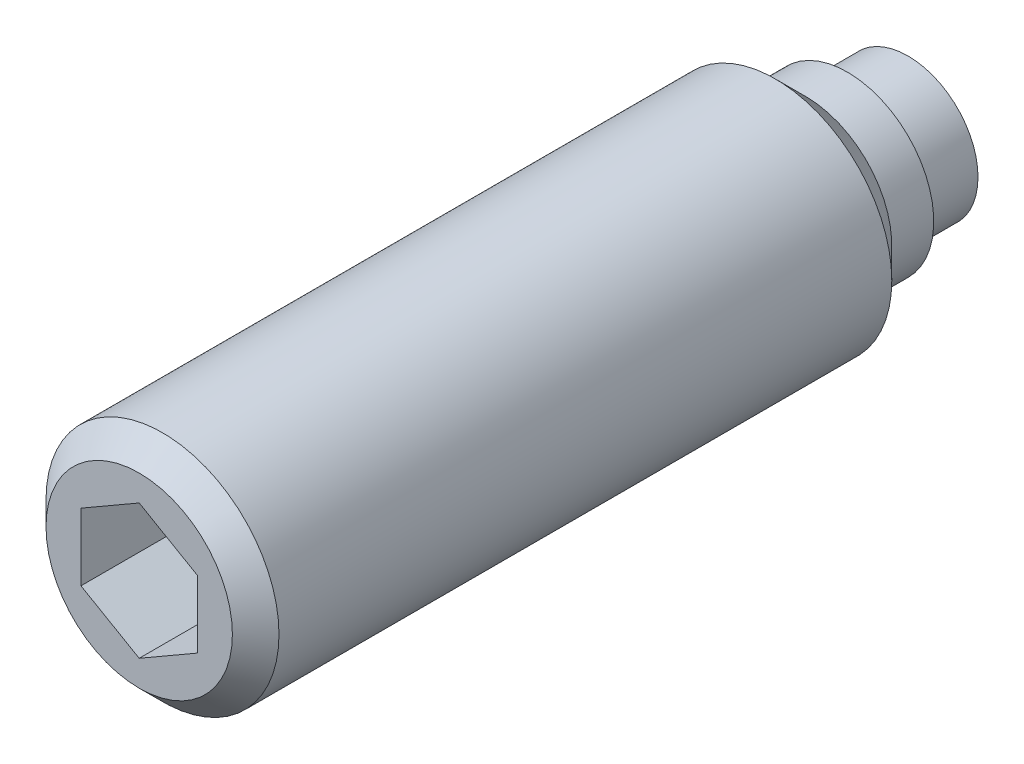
ISO-10303-21;
HEADER;
FILE_DESCRIPTION(('STEP AP214'),'2;1');
FILE_NAME('part.step','',(''),(''),'','','');
FILE_SCHEMA(('AUTOMOTIVE_DESIGN { 1 0 10303 214 1 1 1 1 }'));
ENDSEC;
DATA;
#1=APPLICATION_CONTEXT('core data for automotive mechanical design processes');
#2=APPLICATION_PROTOCOL_DEFINITION('international standard','automotive_design',2000,#1);
#3=PRODUCT_CONTEXT('',#1,'mechanical');
#4=PRODUCT('Part','Part','',(#3));
#5=PRODUCT_RELATED_PRODUCT_CATEGORY('part','',(#4));
#6=PRODUCT_DEFINITION_FORMATION('','',#4);
#7=PRODUCT_DEFINITION_CONTEXT('part definition',#1,'design');
#8=PRODUCT_DEFINITION('design','',#6,#7);
#9=PRODUCT_DEFINITION_SHAPE('','',#8);
#10=(LENGTH_UNIT() NAMED_UNIT(*) SI_UNIT(.MILLI.,.METRE.));
#11=(NAMED_UNIT(*) PLANE_ANGLE_UNIT() SI_UNIT($,.RADIAN.));
#12=(NAMED_UNIT(*) SI_UNIT($,.STERADIAN.) SOLID_ANGLE_UNIT());
#13=UNCERTAINTY_MEASURE_WITH_UNIT(LENGTH_MEASURE(1.E-05),#10,'distance_accuracy_value','');
#14=(GEOMETRIC_REPRESENTATION_CONTEXT(3) GLOBAL_UNCERTAINTY_ASSIGNED_CONTEXT((#13)) GLOBAL_UNIT_ASSIGNED_CONTEXT((#10,
#11,#12)) REPRESENTATION_CONTEXT('',''));
#15=CARTESIAN_POINT('',(0.,0.,0.));
#16=DIRECTION('',(0.,0.,1.));
#17=DIRECTION('',(1.,0.,0.));
#18=AXIS2_PLACEMENT_3D('',#15,#16,#17);
#19=CARTESIAN_POINT('',(0.,1.85,1.8));
#20=DIRECTION('',(0.,0.,1.));
#21=DIRECTION('',(1.,0.,0.));
#22=AXIS2_PLACEMENT_3D('',#19,#20,#21);
#23=PLANE('',#22);
#24=CARTESIAN_POINT('',(0.,0.,1.8));
#25=DIRECTION('',(0.,0.,-1.));
#26=DIRECTION('',(-1.,0.,0.));
#27=AXIS2_PLACEMENT_3D('',#24,#25,#26);
#28=CIRCLE('',#27,1.5);
#29=CARTESIAN_POINT('',(-1.5,0.,1.8));
#30=VERTEX_POINT('',#29);
#31=EDGE_CURVE('E124',#30,#30,#28,.T.);
#32=ORIENTED_EDGE('',*,*,#31,.F.);
#33=EDGE_LOOP('',(#32));
#34=FACE_BOUND('',#33,.T.);
#35=CARTESIAN_POINT('',(0.,0.,1.8));
#36=DIRECTION('',(0.,0.,-1.));
#37=DIRECTION('',(-1.,0.,0.));
#38=AXIS2_PLACEMENT_3D('',#35,#36,#37);
#39=CIRCLE('',#38,1.85);
#40=CARTESIAN_POINT('',(-1.85,0.,1.8));
#41=VERTEX_POINT('',#40);
#42=EDGE_CURVE('E127',#41,#41,#39,.T.);
#43=ORIENTED_EDGE('',*,*,#42,.T.);
#44=EDGE_LOOP('',(#43));
#45=FACE_BOUND('',#44,.T.);
#46=ADVANCED_FACE('F14',(#34,#45),#23,.F.);
#47=CARTESIAN_POINT('',(0.,0.,1.8));
#48=DIRECTION('',(0.,0.,-1.));
#49=DIRECTION('',(-1.,0.,0.));
#50=AXIS2_PLACEMENT_3D('',#47,#48,#49);
#51=CYLINDRICAL_SURFACE('',#50,2.5);
#52=CARTESIAN_POINT('',(0.,0.,16.5));
#53=DIRECTION('',(0.,0.,1.));
#54=DIRECTION('',(1.,0.,0.));
#55=AXIS2_PLACEMENT_3D('',#52,#53,#54);
#56=CIRCLE('',#55,2.5);
#57=CARTESIAN_POINT('',(2.5,0.,16.5));
#58=VERTEX_POINT('',#57);
#59=EDGE_CURVE('E9',#58,#58,#56,.F.);
#60=ORIENTED_EDGE('',*,*,#59,.T.);
#61=EDGE_LOOP('',(#60));
#62=FACE_BOUND('',#61,.T.);
#63=CARTESIAN_POINT('',(0.,0.,3.35));
#64=DIRECTION('',(0.,0.,-1.));
#65=DIRECTION('',(-1.,0.,0.));
#66=AXIS2_PLACEMENT_3D('',#63,#64,#65);
#67=CIRCLE('',#66,2.5);
#68=CARTESIAN_POINT('',(-2.5,0.,3.35));
#69=VERTEX_POINT('',#68);
#70=EDGE_CURVE('E133',#69,#69,#67,.T.);
#71=ORIENTED_EDGE('',*,*,#70,.F.);
#72=EDGE_LOOP('',(#71));
#73=FACE_BOUND('',#72,.T.);
#74=ADVANCED_FACE('F151',(#62,#73),#51,.T.);
#75=CARTESIAN_POINT('',(0.,0.,3.35));
#76=DIRECTION('',(0.,0.,1.));
#77=DIRECTION('',(1.,0.,0.));
#78=AXIS2_PLACEMENT_3D('',#75,#76,#77);
#79=CONICAL_SURFACE('',#78,2.5,0.785398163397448);
#80=CARTESIAN_POINT('',(0.,0.,2.7));
#81=DIRECTION('',(0.,0.,-1.));
#82=DIRECTION('',(-1.,0.,0.));
#83=AXIS2_PLACEMENT_3D('',#80,#81,#82);
#84=CIRCLE('',#83,1.85);
#85=CARTESIAN_POINT('',(-1.85,0.,2.7));
#86=VERTEX_POINT('',#85);
#87=EDGE_CURVE('E130',#86,#86,#84,.T.);
#88=ORIENTED_EDGE('',*,*,#87,.F.);
#89=EDGE_LOOP('',(#88));
#90=FACE_BOUND('',#89,.T.);
#91=ORIENTED_EDGE('',*,*,#70,.T.);
#92=EDGE_LOOP('',(#91));
#93=FACE_BOUND('',#92,.T.);
#94=ADVANCED_FACE('F157',(#90,#93),#79,.T.);
#95=CARTESIAN_POINT('',(0.,0.,1.8));
#96=DIRECTION('',(0.,0.,-1.));
#97=DIRECTION('',(-1.,0.,0.));
#98=AXIS2_PLACEMENT_3D('',#95,#96,#97);
#99=CYLINDRICAL_SURFACE('',#98,1.85);
#100=ORIENTED_EDGE('',*,*,#42,.F.);
#101=EDGE_LOOP('',(#100));
#102=FACE_BOUND('',#101,.T.);
#103=ORIENTED_EDGE('',*,*,#87,.T.);
#104=EDGE_LOOP('',(#103));
#105=FACE_BOUND('',#104,.T.);
#106=ADVANCED_FACE('F165',(#102,#105),#99,.T.);
#107=CARTESIAN_POINT('',(0.,0.,0.));
#108=DIRECTION('',(0.,0.,-1.));
#109=DIRECTION('',(-1.,0.,0.));
#110=AXIS2_PLACEMENT_3D('',#107,#108,#109);
#111=CYLINDRICAL_SURFACE('',#110,1.5);
#112=CARTESIAN_POINT('',(0.,0.,0.5));
#113=DIRECTION('',(0.,0.,-1.));
#114=DIRECTION('',(-1.,0.,0.));
#115=AXIS2_PLACEMENT_3D('',#112,#113,#114);
#116=CIRCLE('',#115,1.5);
#117=CARTESIAN_POINT('',(-1.5,0.,0.5));
#118=VERTEX_POINT('',#117);
#119=EDGE_CURVE('E116',#118,#118,#116,.T.);
#120=ORIENTED_EDGE('',*,*,#119,.F.);
#121=EDGE_LOOP('',(#120));
#122=FACE_BOUND('',#121,.T.);
#123=ORIENTED_EDGE('',*,*,#31,.T.);
#124=EDGE_LOOP('',(#123));
#125=FACE_BOUND('',#124,.T.);
#126=ADVANCED_FACE('F163',(#122,#125),#111,.T.);
#127=CARTESIAN_POINT('',(0.,0.,2.49999999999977));
#128=DIRECTION('',(0.,0.,-1.));
#129=DIRECTION('',(1.,0.,0.));
#130=AXIS2_PLACEMENT_3D('',#127,#128,#129);
#131=SPHERICAL_SURFACE('',#130,2.49999999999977);
#132=ORIENTED_EDGE('',*,*,#119,.T.);
#133=EDGE_LOOP('',(#132));
#134=FACE_BOUND('',#133,.T.);
#135=ADVANCED_FACE('F194',(#134),#131,.T.);
#136=CARTESIAN_POINT('',(0.,0.,17.));
#137=DIRECTION('',(0.,0.,1.));
#138=DIRECTION('',(1.,0.,0.));
#139=AXIS2_PLACEMENT_3D('',#136,#137,#138);
#140=PLANE('',#139);
#141=CARTESIAN_POINT('',(0.,0.,17.));
#142=DIRECTION('',(0.,0.,1.));
#143=DIRECTION('',(1.,0.,0.));
#144=AXIS2_PLACEMENT_3D('',#141,#142,#143);
#145=CIRCLE('',#144,2.);
#146=CARTESIAN_POINT('',(2.,0.,17.));
#147=VERTEX_POINT('',#146);
#148=EDGE_CURVE('E22',#147,#147,#145,.T.);
#149=ORIENTED_EDGE('',*,*,#148,.T.);
#150=EDGE_LOOP('',(#149));
#151=FACE_BOUND('',#150,.T.);
#152=DIRECTION('',(-0.866025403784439,0.5,0.));
#153=VECTOR('',#152,1.);
#154=CARTESIAN_POINT('',(1.25,0.721687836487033,17.));
#155=LINE('',#154,#153);
#156=CARTESIAN_POINT('',(1.25,0.721687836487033,17.));
#157=VERTEX_POINT('',#156);
#158=CARTESIAN_POINT('',(0.,1.44337567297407,17.));
#159=VERTEX_POINT('',#158);
#160=EDGE_CURVE('E29',#157,#159,#155,.T.);
#161=ORIENTED_EDGE('',*,*,#160,.F.);
#162=DIRECTION('',(0.,1.,0.));
#163=VECTOR('',#162,1.);
#164=CARTESIAN_POINT('',(1.25,-0.721687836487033,17.));
#165=LINE('',#164,#163);
#166=CARTESIAN_POINT('',(1.25,-0.721687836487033,17.));
#167=VERTEX_POINT('',#166);
#168=EDGE_CURVE('E112',#167,#157,#165,.T.);
#169=ORIENTED_EDGE('',*,*,#168,.F.);
#170=DIRECTION('',(0.866025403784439,0.5,0.));
#171=VECTOR('',#170,1.);
#172=CARTESIAN_POINT('',(0.,-1.44337567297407,17.));
#173=LINE('',#172,#171);
#174=CARTESIAN_POINT('',(0.,-1.44337567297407,17.));
#175=VERTEX_POINT('',#174);
#176=EDGE_CURVE('E110',#175,#167,#173,.T.);
#177=ORIENTED_EDGE('',*,*,#176,.F.);
#178=DIRECTION('',(0.866025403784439,-0.5,0.));
#179=VECTOR('',#178,1.);
#180=CARTESIAN_POINT('',(-1.25,-0.721687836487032,17.));
#181=LINE('',#180,#179);
#182=CARTESIAN_POINT('',(-1.25,-0.721687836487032,17.));
#183=VERTEX_POINT('',#182);
#184=EDGE_CURVE('E77',#183,#175,#181,.T.);
#185=ORIENTED_EDGE('',*,*,#184,.F.);
#186=DIRECTION('',(0.,-1.,0.));
#187=VECTOR('',#186,1.);
#188=CARTESIAN_POINT('',(-1.25,0.721687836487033,17.));
#189=LINE('',#188,#187);
#190=CARTESIAN_POINT('',(-1.25,0.721687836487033,17.));
#191=VERTEX_POINT('',#190);
#192=EDGE_CURVE('E106',#191,#183,#189,.T.);
#193=ORIENTED_EDGE('',*,*,#192,.F.);
#194=DIRECTION('',(-0.866025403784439,-0.5,0.));
#195=VECTOR('',#194,1.);
#196=CARTESIAN_POINT('',(0.,1.44337567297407,17.));
#197=LINE('',#196,#195);
#198=EDGE_CURVE('E103',#159,#191,#197,.T.);
#199=ORIENTED_EDGE('',*,*,#198,.F.);
#200=EDGE_LOOP('',(#161,#169,#177,#185,#193,#199));
#201=FACE_BOUND('',#200,.T.);
#202=ADVANCED_FACE('F138',(#151,#201),#140,.T.);
#203=CARTESIAN_POINT('',(1.25,0.721687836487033,14.));
#204=DIRECTION('',(0.5,0.866025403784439,0.));
#205=DIRECTION('',(-0.866025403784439,0.5,0.));
#206=AXIS2_PLACEMENT_3D('',#203,#204,#205);
#207=PLANE('',#206);
#208=ORIENTED_EDGE('',*,*,#160,.T.);
#209=DIRECTION('',(0.,0.,1.));
#210=VECTOR('',#209,1.);
#211=CARTESIAN_POINT('',(0.,1.44337567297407,14.));
#212=LINE('',#211,#210);
#213=CARTESIAN_POINT('',(0.,1.44337567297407,14.));
#214=VERTEX_POINT('',#213);
#215=EDGE_CURVE('E59',#214,#159,#212,.T.);
#216=ORIENTED_EDGE('',*,*,#215,.F.);
#217=DIRECTION('',(-0.866025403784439,0.5,0.));
#218=VECTOR('',#217,1.);
#219=CARTESIAN_POINT('',(1.25,0.721687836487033,14.));
#220=LINE('',#219,#218);
#221=CARTESIAN_POINT('',(1.25,0.721687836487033,14.));
#222=VERTEX_POINT('',#221);
#223=EDGE_CURVE('E114',#222,#214,#220,.T.);
#224=ORIENTED_EDGE('',*,*,#223,.F.);
#225=DIRECTION('',(0.,0.,1.));
#226=VECTOR('',#225,1.);
#227=CARTESIAN_POINT('',(1.25,0.721687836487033,14.));
#228=LINE('',#227,#226);
#229=EDGE_CURVE('E37',#222,#157,#228,.T.);
#230=ORIENTED_EDGE('',*,*,#229,.T.);
#231=EDGE_LOOP('',(#208,#216,#224,#230));
#232=FACE_BOUND('',#231,.T.);
#233=ADVANCED_FACE('F209',(#232),#207,.F.);
#234=CARTESIAN_POINT('',(1.25,-0.721687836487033,14.));
#235=DIRECTION('',(1.,0.,0.));
#236=DIRECTION('',(0.,0.,-1.));
#237=AXIS2_PLACEMENT_3D('',#234,#235,#236);
#238=PLANE('',#237);
#239=ORIENTED_EDGE('',*,*,#168,.T.);
#240=ORIENTED_EDGE('',*,*,#229,.F.);
#241=DIRECTION('',(0.,1.,0.));
#242=VECTOR('',#241,1.);
#243=CARTESIAN_POINT('',(1.25,-0.721687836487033,14.));
#244=LINE('',#243,#242);
#245=CARTESIAN_POINT('',(1.25,-0.721687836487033,14.));
#246=VERTEX_POINT('',#245);
#247=EDGE_CURVE('E89',#246,#222,#244,.T.);
#248=ORIENTED_EDGE('',*,*,#247,.F.);
#249=DIRECTION('',(0.,0.,1.));
#250=VECTOR('',#249,1.);
#251=CARTESIAN_POINT('',(1.25,-0.721687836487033,14.));
#252=LINE('',#251,#250);
#253=EDGE_CURVE('E81',#246,#167,#252,.T.);
#254=ORIENTED_EDGE('',*,*,#253,.T.);
#255=EDGE_LOOP('',(#239,#240,#248,#254));
#256=FACE_BOUND('',#255,.T.);
#257=ADVANCED_FACE('F217',(#256),#238,.F.);
#258=CARTESIAN_POINT('',(0.,-1.44337567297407,14.));
#259=DIRECTION('',(0.5,-0.866025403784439,0.));
#260=DIRECTION('',(0.866025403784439,0.5,0.));
#261=AXIS2_PLACEMENT_3D('',#258,#259,#260);
#262=PLANE('',#261);
#263=ORIENTED_EDGE('',*,*,#176,.T.);
#264=ORIENTED_EDGE('',*,*,#253,.F.);
#265=DIRECTION('',(0.866025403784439,0.5,0.));
#266=VECTOR('',#265,1.);
#267=CARTESIAN_POINT('',(0.,-1.44337567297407,14.));
#268=LINE('',#267,#266);
#269=CARTESIAN_POINT('',(0.,-1.44337567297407,14.));
#270=VERTEX_POINT('',#269);
#271=EDGE_CURVE('E85',#270,#246,#268,.T.);
#272=ORIENTED_EDGE('',*,*,#271,.F.);
#273=DIRECTION('',(0.,0.,1.));
#274=VECTOR('',#273,1.);
#275=CARTESIAN_POINT('',(0.,-1.44337567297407,14.));
#276=LINE('',#275,#274);
#277=EDGE_CURVE('E70',#270,#175,#276,.T.);
#278=ORIENTED_EDGE('',*,*,#277,.T.);
#279=EDGE_LOOP('',(#263,#264,#272,#278));
#280=FACE_BOUND('',#279,.T.);
#281=ADVANCED_FACE('F86',(#280),#262,.F.);
#282=CARTESIAN_POINT('',(-1.25,-0.721687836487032,14.));
#283=DIRECTION('',(-0.5,-0.866025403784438,0.));
#284=DIRECTION('',(0.866025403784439,-0.5,0.));
#285=AXIS2_PLACEMENT_3D('',#282,#283,#284);
#286=PLANE('',#285);
#287=ORIENTED_EDGE('',*,*,#184,.T.);
#288=ORIENTED_EDGE('',*,*,#277,.F.);
#289=DIRECTION('',(0.866025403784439,-0.5,0.));
#290=VECTOR('',#289,1.);
#291=CARTESIAN_POINT('',(-1.25,-0.721687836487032,14.));
#292=LINE('',#291,#290);
#293=CARTESIAN_POINT('',(-1.25,-0.721687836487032,14.));
#294=VERTEX_POINT('',#293);
#295=EDGE_CURVE('E74',#294,#270,#292,.T.);
#296=ORIENTED_EDGE('',*,*,#295,.F.);
#297=DIRECTION('',(0.,0.,1.));
#298=VECTOR('',#297,1.);
#299=CARTESIAN_POINT('',(-1.25,-0.721687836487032,14.));
#300=LINE('',#299,#298);
#301=EDGE_CURVE('E82',#294,#183,#300,.T.);
#302=ORIENTED_EDGE('',*,*,#301,.T.);
#303=EDGE_LOOP('',(#287,#288,#296,#302));
#304=FACE_BOUND('',#303,.T.);
#305=ADVANCED_FACE('F72',(#304),#286,.F.);
#306=CARTESIAN_POINT('',(-1.25,0.721687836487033,14.));
#307=DIRECTION('',(-1.,0.,0.));
#308=DIRECTION('',(0.,-1.,0.));
#309=AXIS2_PLACEMENT_3D('',#306,#307,#308);
#310=PLANE('',#309);
#311=ORIENTED_EDGE('',*,*,#192,.T.);
#312=ORIENTED_EDGE('',*,*,#301,.F.);
#313=DIRECTION('',(0.,-1.,0.));
#314=VECTOR('',#313,1.);
#315=CARTESIAN_POINT('',(-1.25,0.721687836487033,14.));
#316=LINE('',#315,#314);
#317=CARTESIAN_POINT('',(-1.25,0.721687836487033,14.));
#318=VERTEX_POINT('',#317);
#319=EDGE_CURVE('E95',#318,#294,#316,.T.);
#320=ORIENTED_EDGE('',*,*,#319,.F.);
#321=DIRECTION('',(0.,0.,1.));
#322=VECTOR('',#321,1.);
#323=CARTESIAN_POINT('',(-1.25,0.721687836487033,14.));
#324=LINE('',#323,#322);
#325=EDGE_CURVE('E119',#318,#191,#324,.T.);
#326=ORIENTED_EDGE('',*,*,#325,.T.);
#327=EDGE_LOOP('',(#311,#312,#320,#326));
#328=FACE_BOUND('',#327,.T.);
#329=ADVANCED_FACE('F239',(#328),#310,.F.);
#330=CARTESIAN_POINT('',(0.,1.44337567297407,14.));
#331=DIRECTION('',(-0.5,0.866025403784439,0.));
#332=DIRECTION('',(-0.866025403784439,-0.5,0.));
#333=AXIS2_PLACEMENT_3D('',#330,#331,#332);
#334=PLANE('',#333);
#335=ORIENTED_EDGE('',*,*,#198,.T.);
#336=ORIENTED_EDGE('',*,*,#325,.F.);
#337=DIRECTION('',(-0.866025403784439,-0.5,0.));
#338=VECTOR('',#337,1.);
#339=CARTESIAN_POINT('',(0.,1.44337567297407,14.));
#340=LINE('',#339,#338);
#341=EDGE_CURVE('E97',#214,#318,#340,.T.);
#342=ORIENTED_EDGE('',*,*,#341,.F.);
#343=ORIENTED_EDGE('',*,*,#215,.T.);
#344=EDGE_LOOP('',(#335,#336,#342,#343));
#345=FACE_BOUND('',#344,.T.);
#346=ADVANCED_FACE('F147',(#345),#334,.F.);
#347=CARTESIAN_POINT('',(0.,0.,14.));
#348=DIRECTION('',(0.,0.,1.));
#349=DIRECTION('',(1.,0.,0.));
#350=AXIS2_PLACEMENT_3D('',#347,#348,#349);
#351=PLANE('',#350);
#352=ORIENTED_EDGE('',*,*,#223,.T.);
#353=ORIENTED_EDGE('',*,*,#341,.T.);
#354=ORIENTED_EDGE('',*,*,#319,.T.);
#355=ORIENTED_EDGE('',*,*,#295,.T.);
#356=ORIENTED_EDGE('',*,*,#271,.T.);
#357=ORIENTED_EDGE('',*,*,#247,.T.);
#358=EDGE_LOOP('',(#352,#353,#354,#355,#356,#357));
#359=FACE_BOUND('',#358,.T.);
#360=ADVANCED_FACE('F92',(#359),#351,.T.);
#361=CARTESIAN_POINT('',(0.,0.,17.));
#362=DIRECTION('',(0.,0.,-1.));
#363=DIRECTION('',(-1.,0.,0.));
#364=AXIS2_PLACEMENT_3D('',#361,#362,#363);
#365=CONICAL_SURFACE('',#364,2.,0.78539816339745);
#366=ORIENTED_EDGE('',*,*,#59,.F.);
#367=EDGE_LOOP('',(#366));
#368=FACE_BOUND('',#367,.T.);
#369=ORIENTED_EDGE('',*,*,#148,.F.);
#370=EDGE_LOOP('',(#369));
#371=FACE_BOUND('',#370,.T.);
#372=ADVANCED_FACE('F16',(#368,#371),#365,.T.);
#373=CLOSED_SHELL('',(#46,#74,#94,#106,#126,#135,#202,#233,#257,#281,#305,#329,#346,#360,#372));
#374=MANIFOLD_SOLID_BREP('B1',#373);
#375=ADVANCED_BREP_SHAPE_REPRESENTATION('',(#18,#374),#14);
#376=SHAPE_DEFINITION_REPRESENTATION(#9,#375);
ENDSEC;
END-ISO-10303-21;
